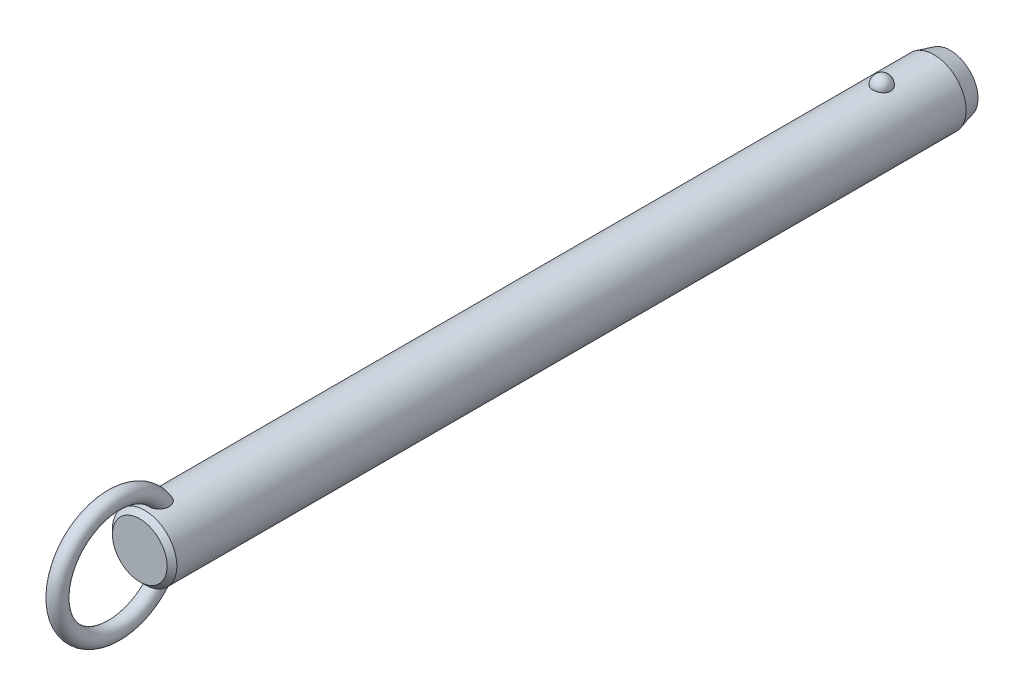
ISO-10303-21;
HEADER;
FILE_DESCRIPTION(('STEP AP214'),'2;1');
FILE_NAME('part.step','',(''),(''),'','','');
FILE_SCHEMA(('AUTOMOTIVE_DESIGN { 1 0 10303 214 1 1 1 1 }'));
ENDSEC;
DATA;
#1=APPLICATION_CONTEXT('core data for automotive mechanical design processes');
#2=APPLICATION_PROTOCOL_DEFINITION('international standard','automotive_design',2000,#1);
#3=PRODUCT_CONTEXT('',#1,'mechanical');
#4=PRODUCT('Part','Part','',(#3));
#5=PRODUCT_RELATED_PRODUCT_CATEGORY('part','',(#4));
#6=PRODUCT_DEFINITION_FORMATION('','',#4);
#7=PRODUCT_DEFINITION_CONTEXT('part definition',#1,'design');
#8=PRODUCT_DEFINITION('design','',#6,#7);
#9=PRODUCT_DEFINITION_SHAPE('','',#8);
#10=(LENGTH_UNIT() NAMED_UNIT(*) SI_UNIT(.MILLI.,.METRE.));
#11=(NAMED_UNIT(*) PLANE_ANGLE_UNIT() SI_UNIT($,.RADIAN.));
#12=(NAMED_UNIT(*) SI_UNIT($,.STERADIAN.) SOLID_ANGLE_UNIT());
#13=UNCERTAINTY_MEASURE_WITH_UNIT(LENGTH_MEASURE(1.E-05),#10,'distance_accuracy_value','');
#14=(GEOMETRIC_REPRESENTATION_CONTEXT(3) GLOBAL_UNCERTAINTY_ASSIGNED_CONTEXT((#13)) GLOBAL_UNIT_ASSIGNED_CONTEXT((#10,
#11,#12)) REPRESENTATION_CONTEXT('',''));
#15=CARTESIAN_POINT('',(0.,0.,0.));
#16=DIRECTION('',(0.,0.,1.));
#17=DIRECTION('',(1.,0.,0.));
#18=AXIS2_PLACEMENT_3D('',#15,#16,#17);
#19=CARTESIAN_POINT('',(0.,0.,170.2));
#20=DIRECTION('',(0.,0.,-1.));
#21=DIRECTION('',(-1.,0.,0.));
#22=AXIS2_PLACEMENT_3D('',#19,#20,#21);
#23=CYLINDRICAL_SURFACE('',#22,7.9);
#24=CARTESIAN_POINT('',(2.1785689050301,7.59367088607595,-2.20000000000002));
#25=CARTESIAN_POINT('',(2.17856679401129,7.59367269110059,-2.07701843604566));
#26=CARTESIAN_POINT('',(2.16853481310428,7.59657145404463,-1.95401006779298));
#27=CARTESIAN_POINT('',(2.12864689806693,7.607843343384,-1.71147811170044));
#28=CARTESIAN_POINT('',(2.09878338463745,7.61621856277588,-1.5919558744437));
#29=CARTESIAN_POINT('',(2.0199931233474,7.63749180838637,-1.35985638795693));
#30=CARTESIAN_POINT('',(1.97107475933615,7.6503878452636,-1.24727610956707));
#31=CARTESIAN_POINT('',(1.85539377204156,7.67926115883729,-1.03213234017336));
#32=CARTESIAN_POINT('',(1.78863158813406,7.69523835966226,-0.929568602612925));
#33=CARTESIAN_POINT('',(1.63856494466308,7.7285848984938,-0.73678633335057));
#34=CARTESIAN_POINT('',(1.55518140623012,7.7459606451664,-0.646630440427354));
#35=CARTESIAN_POINT('',(1.37422937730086,7.78009978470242,-0.481747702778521));
#36=CARTESIAN_POINT('',(1.27666086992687,7.79686317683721,-0.407020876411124));
#37=CARTESIAN_POINT('',(1.07024728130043,7.82786153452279,-0.275278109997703));
#38=CARTESIAN_POINT('',(0.961434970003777,7.84210353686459,-0.218212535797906));
#39=CARTESIAN_POINT('',(0.735351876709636,7.86652194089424,-0.123146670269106));
#40=CARTESIAN_POINT('',(0.618082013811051,7.87669878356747,-0.0851443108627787));
#41=CARTESIAN_POINT('',(0.380637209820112,7.89170521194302,-0.0298158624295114));
#42=CARTESIAN_POINT('',(0.260550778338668,7.89662650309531,-0.0121347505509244));
#43=CARTESIAN_POINT('',(0.0190117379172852,7.90090003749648,0.00324379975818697));
#44=CARTESIAN_POINT('',(-0.102440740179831,7.90025280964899,0.000943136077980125));
#45=CARTESIAN_POINT('',(-0.341452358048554,7.89351056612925,-0.0233955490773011));
#46=CARTESIAN_POINT('',(-0.459042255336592,7.88749257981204,-0.0451545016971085));
#47=CARTESIAN_POINT('',(-0.688796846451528,7.87075812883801,-0.107408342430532));
#48=CARTESIAN_POINT('',(-0.800961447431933,7.86004158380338,-0.14790355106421));
#49=CARTESIAN_POINT('',(-1.01743634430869,7.83497131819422,-0.246799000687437));
#50=CARTESIAN_POINT('',(-1.12169791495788,7.82059709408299,-0.305300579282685));
#51=CARTESIAN_POINT('',(-1.31891765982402,7.78976470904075,-0.43854939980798));
#52=CARTESIAN_POINT('',(-1.41187469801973,7.77330633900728,-0.513298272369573));
#53=CARTESIAN_POINT('',(-1.58577142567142,7.73972434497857,-0.678622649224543));
#54=CARTESIAN_POINT('',(-1.66645140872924,7.72259402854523,-0.769470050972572));
#55=CARTESIAN_POINT('',(-1.81161503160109,7.68983776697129,-0.963538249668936));
#56=CARTESIAN_POINT('',(-1.87609753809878,7.6742119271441,-1.0667599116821));
#57=CARTESIAN_POINT('',(-1.98790138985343,7.6460202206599,-1.28401170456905));
#58=CARTESIAN_POINT('',(-2.03501994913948,7.63349104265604,-1.39815107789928));
#59=CARTESIAN_POINT('',(-2.10986724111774,7.6131449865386,-1.6330178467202));
#60=CARTESIAN_POINT('',(-2.1375965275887,7.60532797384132,-1.75374505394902));
#61=CARTESIAN_POINT('',(-2.17289256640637,7.5953195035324,-1.99782562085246));
#62=CARTESIAN_POINT('',(-2.18054294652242,7.59310471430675,-2.12116592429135));
#63=CARTESIAN_POINT('',(-2.17572919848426,7.59448538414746,-2.36741799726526));
#64=CARTESIAN_POINT('',(-2.1632656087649,7.59808068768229,-2.49032977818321));
#65=CARTESIAN_POINT('',(-2.11865035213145,7.61064035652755,-2.73161015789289));
#66=CARTESIAN_POINT('',(-2.08659579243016,7.61957823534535,-2.84999812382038));
#67=CARTESIAN_POINT('',(-2.00367799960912,7.64179982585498,-3.07955956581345));
#68=CARTESIAN_POINT('',(-1.9528140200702,7.65508371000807,-3.19073275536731));
#69=CARTESIAN_POINT('',(-1.83321113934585,7.68460381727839,-3.40337899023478));
#70=CARTESIAN_POINT('',(-1.76437735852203,7.70085556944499,-3.5047965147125));
#71=CARTESIAN_POINT('',(-1.61069526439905,7.73445734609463,-3.69446912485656));
#72=CARTESIAN_POINT('',(-1.52584634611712,7.75180741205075,-3.78272371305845));
#73=CARTESIAN_POINT('',(-1.34198059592,7.78574608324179,-3.94393987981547));
#74=CARTESIAN_POINT('',(-1.24291308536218,7.80233167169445,-4.01684434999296));
#75=CARTESIAN_POINT('',(-1.03352039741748,7.83281625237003,-4.14489386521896));
#76=CARTESIAN_POINT('',(-0.92319600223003,7.84671543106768,-4.20004014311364));
#77=CARTESIAN_POINT('',(-0.695822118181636,7.87011575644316,-4.29042017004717));
#78=CARTESIAN_POINT('',(-0.578872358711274,7.87966903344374,-4.32589112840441));
#79=CARTESIAN_POINT('',(-0.340410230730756,7.8935652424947,-4.37692226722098));
#80=CARTESIAN_POINT('',(-0.218898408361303,7.89790879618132,-4.39248482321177));
#81=CARTESIAN_POINT('',(0.0228107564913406,7.90087453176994,-4.40314405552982));
#82=CARTESIAN_POINT('',(0.142990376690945,7.89960185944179,-4.39861683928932));
#83=CARTESIAN_POINT('',(0.380829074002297,7.89171262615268,-4.37008293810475));
#84=CARTESIAN_POINT('',(0.498488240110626,7.8850962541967,-4.34607694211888));
#85=CARTESIAN_POINT('',(0.727535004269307,7.86726442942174,-4.27939317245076));
#86=CARTESIAN_POINT('',(0.838944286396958,7.85606616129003,-4.23678512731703));
#87=CARTESIAN_POINT('',(1.05295421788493,7.83025654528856,-4.13408348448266));
#88=CARTESIAN_POINT('',(1.15555431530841,7.81564498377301,-4.07398879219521));
#89=CARTESIAN_POINT('',(1.35076763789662,7.7843022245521,-3.93687432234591));
#90=CARTESIAN_POINT('',(1.4432046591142,7.76754209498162,-3.85961036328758));
#91=CARTESIAN_POINT('',(1.6139111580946,7.73387857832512,-3.69076949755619));
#92=CARTESIAN_POINT('',(1.6921781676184,7.71697516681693,-3.59919010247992));
#93=CARTESIAN_POINT('',(1.83380875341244,7.6845643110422,-3.40247278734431));
#94=CARTESIAN_POINT('',(1.89689280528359,7.66908588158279,-3.29712873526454));
#95=CARTESIAN_POINT('',(2.0047823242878,7.64159441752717,-3.07707931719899));
#96=CARTESIAN_POINT('',(2.0495945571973,7.62958010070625,-2.96237743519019));
#97=CARTESIAN_POINT('',(2.11580183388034,7.61146617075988,-2.74040519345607));
#98=CARTESIAN_POINT('',(2.13929812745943,7.60484503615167,-2.63379846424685));
#99=CARTESIAN_POINT('',(2.17068242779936,7.59594664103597,-2.4181348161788));
#100=CARTESIAN_POINT('',(2.17857077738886,7.59366928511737,-2.30907795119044));
#101=CARTESIAN_POINT('',(2.1785689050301,7.59367088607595,-2.20000000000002));
#102=B_SPLINE_CURVE_WITH_KNOTS('',3,(#24,#25,#26,#27,#28,#29,#30,#31,#32,#33,#34,#35,#36,#37,
#38,#39,#40,#41,#42,#43,#44,#45,#46,#47,#48,#49,#50,#51,#52,#53,#54,#55,#56,#57,#58,#59,#60,#61,
#62,#63,#64,#65,#66,#67,#68,#69,#70,#71,#72,#73,#74,#75,#76,#77,#78,#79,#80,#81,#82,#83,#84,#85,
#86,#87,#88,#89,#90,#91,#92,#93,#94,#95,#96,#97,#98,#99,#100,#101),.UNSPECIFIED.,.T.,.F.,(4,2,2,
2,2,2,2,2,2,2,2,2,2,2,2,2,2,2,2,2,2,2,2,2,2,2,2,2,2,2,2,2,2,2,2,2,2,2,4),(0.,0.368552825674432,
0.737246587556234,1.10577831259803,1.4743009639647,1.8446206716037,2.21494081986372,
2.5842105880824,2.95344028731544,3.31611630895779,3.67875788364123,4.03628044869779,
4.39380913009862,4.75338791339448,5.11300280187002,5.47939989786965,5.8458226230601,
6.21639834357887,6.58696347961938,6.95598276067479,7.32499216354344,7.69218715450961,
8.0593967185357,8.42858578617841,8.79778880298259,9.16834203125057,9.5388695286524,
9.90482699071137,10.2707407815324,10.6298333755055,10.9889132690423,11.3466585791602,
11.7044262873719,12.0676511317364,12.4309391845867,12.8004764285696,13.1698767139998,
13.4967701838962,13.8236564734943),.UNSPECIFIED.);
#103=CARTESIAN_POINT('',(2.1785689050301,7.59367088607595,-2.20000000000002));
#104=VERTEX_POINT('',#103);
#105=EDGE_CURVE('E41',#104,#104,#102,.T.);
#106=ORIENTED_EDGE('',*,*,#105,.T.);
#107=EDGE_LOOP('',(#106));
#108=FACE_BOUND('',#107,.T.);
#109=CARTESIAN_POINT('',(0.,0.,178.52));
#110=DIRECTION('',(0.,0.,1.));
#111=DIRECTION('',(1.,0.,0.));
#112=AXIS2_PLACEMENT_3D('',#109,#110,#111);
#113=CIRCLE('',#112,7.9);
#114=CARTESIAN_POINT('',(7.9,0.,178.52));
#115=VERTEX_POINT('',#114);
#116=EDGE_CURVE('E10',#115,#115,#113,.F.);
#117=ORIENTED_EDGE('',*,*,#116,.T.);
#118=EDGE_LOOP('',(#117));
#119=FACE_BOUND('',#118,.T.);
#120=CARTESIAN_POINT('',(-0.630969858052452,-7.87476203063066,172.412432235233));
#121=CARTESIAN_POINT('',(-0.734180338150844,-7.86648998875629,172.447285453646));
#122=CARTESIAN_POINT('',(-0.834476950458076,-7.85639291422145,172.490816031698));
#123=CARTESIAN_POINT('',(-1.02620356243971,-7.83366343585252,172.594094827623));
#124=CARTESIAN_POINT('',(-1.1176141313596,-7.82102565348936,172.653877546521));
#125=CARTESIAN_POINT('',(-1.28877277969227,-7.79464922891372,172.787839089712));
#126=CARTESIAN_POINT('',(-1.36854014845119,-7.7809124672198,172.861993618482));
#127=CARTESIAN_POINT('',(-1.51461521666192,-7.75380398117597,173.022494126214));
#128=CARTESIAN_POINT('',(-1.58092966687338,-7.74043207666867,173.108833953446));
#129=CARTESIAN_POINT('',(-1.70019064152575,-7.7151252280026,173.292978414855));
#130=CARTESIAN_POINT('',(-1.75284037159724,-7.70322473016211,173.390979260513));
#131=CARTESIAN_POINT('',(-1.84263464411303,-7.68224112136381,173.594102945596));
#132=CARTESIAN_POINT('',(-1.87977299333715,-7.6731591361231,173.699228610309));
#133=CARTESIAN_POINT('',(-1.94152728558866,-7.65777930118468,173.923284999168));
#134=CARTESIAN_POINT('',(-1.96475471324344,-7.65179654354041,174.042616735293));
#135=CARTESIAN_POINT('',(-1.99449499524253,-7.64409642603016,174.28342986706));
#136=CARTESIAN_POINT('',(-2.0010005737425,-7.64238092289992,174.404912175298));
#137=CARTESIAN_POINT('',(-1.99856014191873,-7.64302120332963,174.668340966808));
#138=CARTESIAN_POINT('',(-1.98680021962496,-7.64611845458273,174.81025654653));
#139=CARTESIAN_POINT('',(-1.94457772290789,-7.65696186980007,175.091118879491));
#140=CARTESIAN_POINT('',(-1.91409393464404,-7.66471330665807,175.230062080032));
#141=CARTESIAN_POINT('',(-1.82768670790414,-7.68582947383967,175.531939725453));
#142=CARTESIAN_POINT('',(-1.76772963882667,-7.70003779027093,175.693686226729));
#143=CARTESIAN_POINT('',(-1.65998501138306,-7.72371550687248,175.927695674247));
#144=CARTESIAN_POINT('',(-1.62107967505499,-7.73200670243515,176.004297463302));
#145=CARTESIAN_POINT('',(-1.53727726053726,-7.74910377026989,176.154079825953));
#146=CARTESIAN_POINT('',(-1.4923821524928,-7.75790947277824,176.227261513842));
#147=CARTESIAN_POINT('',(-1.37397050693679,-7.77993338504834,176.40288382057));
#148=CARTESIAN_POINT('',(-1.29690364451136,-7.79328473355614,176.502955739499));
#149=CARTESIAN_POINT('',(-1.1288548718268,-7.81939266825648,176.690714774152));
#150=CARTESIAN_POINT('',(-1.03789926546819,-7.83215032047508,176.778424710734));
#151=CARTESIAN_POINT('',(-0.869532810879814,-7.85231710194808,176.913414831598));
#152=CARTESIAN_POINT('',(-0.795716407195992,-7.86021093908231,176.965076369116));
#153=CARTESIAN_POINT('',(-0.640813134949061,-7.87434920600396,177.056381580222));
#154=CARTESIAN_POINT('',(-0.559737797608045,-7.88059619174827,177.09604389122));
#155=CARTESIAN_POINT('',(-0.406456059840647,-7.88984116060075,177.154300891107));
#156=CARTESIAN_POINT('',(-0.335227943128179,-7.89321892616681,177.175384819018));
#157=CARTESIAN_POINT('',(-0.190193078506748,-7.89804235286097,177.20541418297));
#158=CARTESIAN_POINT('',(-0.11638863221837,-7.89948969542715,177.214370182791));
#159=CARTESIAN_POINT('',(0.0318414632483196,-7.90028409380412,177.219291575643));
#160=CARTESIAN_POINT('',(0.106268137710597,-7.89962640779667,177.215227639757));
#161=CARTESIAN_POINT('',(0.253290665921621,-7.8962818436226,177.194461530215));
#162=CARTESIAN_POINT('',(0.325885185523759,-7.8935935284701,177.177750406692));
#163=CARTESIAN_POINT('',(0.481441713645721,-7.88577340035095,177.128738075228));
#164=CARTESIAN_POINT('',(0.563611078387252,-7.88026321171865,177.094005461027));
#165=CARTESIAN_POINT('',(0.721129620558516,-7.86741729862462,177.011796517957));
#166=CARTESIAN_POINT('',(0.79646633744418,-7.86007832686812,176.964297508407));
#167=CARTESIAN_POINT('',(0.971456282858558,-7.84073285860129,176.836513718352));
#168=CARTESIAN_POINT('',(1.06719686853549,-7.82809461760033,176.751004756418));
#169=CARTESIAN_POINT('',(1.24418921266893,-7.80192439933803,176.566232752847));
#170=CARTESIAN_POINT('',(1.32540832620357,-7.78839049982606,176.466939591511));
#171=CARTESIAN_POINT('',(1.45199971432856,-7.76559693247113,176.289576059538));
#172=CARTESIAN_POINT('',(1.50085649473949,-7.75626094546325,176.213954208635));
#173=CARTESIAN_POINT('',(1.59197749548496,-7.7380727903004,176.058742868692));
#174=CARTESIAN_POINT('',(1.63423919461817,-7.72922080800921,175.979151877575));
#175=CARTESIAN_POINT('',(1.71222612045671,-7.71231959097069,175.816664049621));
#176=CARTESIAN_POINT('',(1.74794516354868,-7.70427111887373,175.733764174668));
#177=CARTESIAN_POINT('',(1.81270113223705,-7.68929240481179,175.565296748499));
#178=CARTESIAN_POINT('',(1.84173789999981,-7.68236218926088,175.479729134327));
#179=CARTESIAN_POINT('',(1.89322698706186,-7.6698375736,175.30528702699));
#180=CARTESIAN_POINT('',(1.91558744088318,-7.66426199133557,175.216383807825));
#181=CARTESIAN_POINT('',(1.95281367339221,-7.65485915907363,175.036969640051));
#182=CARTESIAN_POINT('',(1.96767946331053,-7.65103190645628,174.946458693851));
#183=CARTESIAN_POINT('',(2.00021456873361,-7.64262981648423,174.673732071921));
#184=CARTESIAN_POINT('',(2.00600691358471,-7.6410871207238,174.489709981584));
#185=CARTESIAN_POINT('',(1.98445334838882,-7.64669564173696,174.176501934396));
#186=CARTESIAN_POINT('',(1.96607186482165,-7.65149688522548,174.046618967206));
#187=CARTESIAN_POINT('',(1.90884967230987,-7.6659762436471,173.791632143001));
#188=CARTESIAN_POINT('',(1.87002101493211,-7.67565148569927,173.666525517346));
#189=CARTESIAN_POINT('',(1.77063986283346,-7.69918471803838,173.42454013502));
#190=CARTESIAN_POINT('',(1.70993724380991,-7.71307150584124,173.307725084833));
#191=CARTESIAN_POINT('',(1.56733070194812,-7.74330306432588,173.088144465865));
#192=CARTESIAN_POINT('',(1.48543692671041,-7.75964665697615,172.985372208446));
#193=CARTESIAN_POINT('',(1.31346177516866,-7.79047523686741,172.809380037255));
#194=CARTESIAN_POINT('',(1.22547278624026,-7.80495298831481,172.734106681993));
#195=CARTESIAN_POINT('',(1.0372435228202,-7.83218597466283,172.600486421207));
#196=CARTESIAN_POINT('',(0.937008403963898,-7.84494192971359,172.542132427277));
#197=CARTESIAN_POINT('',(0.733599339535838,-7.86649045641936,172.447027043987));
#198=CARTESIAN_POINT('',(0.63094101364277,-7.87547134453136,172.409210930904));
#199=CARTESIAN_POINT('',(0.420465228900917,-7.88950708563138,172.351116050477));
#200=CARTESIAN_POINT('',(0.31264590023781,-7.89456050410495,172.33084369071));
#201=CARTESIAN_POINT('',(0.0960869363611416,-7.9001518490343,172.308455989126));
#202=CARTESIAN_POINT('',(-0.012634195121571,-7.90073226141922,172.306169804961));
#203=CARTESIAN_POINT('',(-0.228766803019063,-7.89742350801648,172.319367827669));
#204=CARTESIAN_POINT('',(-0.336180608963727,-7.89354403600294,172.334813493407));
#205=CARTESIAN_POINT('',(-0.473410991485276,-7.88586871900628,172.366217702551));
#206=CARTESIAN_POINT('',(-0.505257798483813,-7.88388984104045,172.374354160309));
#207=CARTESIAN_POINT('',(-0.568481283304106,-7.87958326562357,172.392208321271));
#208=CARTESIAN_POINT('',(-0.599857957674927,-7.87725556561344,172.401926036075));
#209=CARTESIAN_POINT('',(-0.630969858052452,-7.87476203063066,172.412432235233));
#210=B_SPLINE_CURVE_WITH_KNOTS('',3,(#120,#121,#122,#123,#124,#125,#126,#127,#128,#129,#130,
#131,#132,#133,#134,#135,#136,#137,#138,#139,#140,#141,#142,#143,#144,#145,#146,#147,#148,#149,
#150,#151,#152,#153,#154,#155,#156,#157,#158,#159,#160,#161,#162,#163,#164,#165,#166,#167,#168,
#169,#170,#171,#172,#173,#174,#175,#176,#177,#178,#179,#180,#181,#182,#183,#184,#185,#186,#187,
#188,#189,#190,#191,#192,#193,#194,#195,#196,#197,#198,#199,#200,#201,#202,#203,#204,#205,#206,
#207,#208,#209),.UNSPECIFIED.,.T.,.F.,(4,2,2,2,2,2,2,2,2,2,2,2,2,2,2,2,2,2,2,2,2,2,2,2,2,2,2,2,
2,2,2,2,2,2,2,2,2,2,2,2,2,2,2,2,4),(0.,0.327622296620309,0.655945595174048,0.98371863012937,
1.3113267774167,1.64554655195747,1.97989964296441,2.34365728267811,2.70757317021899,
3.13333684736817,3.55958380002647,4.07655306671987,4.33527897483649,4.59391999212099,
4.97382437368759,5.353017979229,5.62348245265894,5.89352465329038,6.11565959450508,
6.33760092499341,6.56004255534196,6.78264174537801,7.04930844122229,7.31645206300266,
7.70130871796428,8.08701995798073,8.35824509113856,8.62957365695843,8.90115735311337,
9.1727474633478,9.44791855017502,9.72308922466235,10.2715298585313,10.6638393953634,
11.0559179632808,11.4507403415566,11.8453740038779,12.1936425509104,12.5417649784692,
12.8695063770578,13.1973674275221,13.5221104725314,13.8461490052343,13.9449071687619,
14.0436660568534),.UNSPECIFIED.);
#211=CARTESIAN_POINT('',(-0.630969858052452,-7.87476203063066,172.412432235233));
#212=VERTEX_POINT('',#211);
#213=EDGE_CURVE('E59',#212,#212,#210,.T.);
#214=ORIENTED_EDGE('',*,*,#213,.T.);
#215=EDGE_LOOP('',(#214));
#216=FACE_BOUND('',#215,.T.);
#217=CARTESIAN_POINT('',(-0.630969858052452,7.87476203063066,172.412432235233));
#218=CARTESIAN_POINT('',(-0.528918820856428,7.88293636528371,172.377979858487));
#219=CARTESIAN_POINT('',(-0.423745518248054,7.88934810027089,172.351915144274));
#220=CARTESIAN_POINT('',(-0.210236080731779,7.8979273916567,172.317282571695));
#221=CARTESIAN_POINT('',(-0.101893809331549,7.90008607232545,172.308751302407));
#222=CARTESIAN_POINT('',(0.11466056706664,7.89990877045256,172.309457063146));
#223=CARTESIAN_POINT('',(0.222872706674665,7.89757640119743,172.31867980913));
#224=CARTESIAN_POINT('',(0.436107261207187,7.88867538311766,172.354652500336));
#225=CARTESIAN_POINT('',(0.541131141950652,7.8821087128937,172.38139425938));
#226=CARTESIAN_POINT('',(0.745085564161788,7.86545130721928,172.451756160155));
#227=CARTESIAN_POINT('',(0.844015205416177,7.85536005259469,172.495378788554));
#228=CARTESIAN_POINT('',(1.03299167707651,7.83275153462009,172.598379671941));
#229=CARTESIAN_POINT('',(1.12303841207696,7.8202342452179,172.657758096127));
#230=CARTESIAN_POINT('',(1.29214734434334,7.79408219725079,172.790864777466));
#231=CARTESIAN_POINT('',(1.37116907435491,7.78044359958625,172.864643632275));
#232=CARTESIAN_POINT('',(1.51597677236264,7.75353170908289,173.024235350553));
#233=CARTESIAN_POINT('',(1.58176261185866,7.74025841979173,173.110048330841));
#234=CARTESIAN_POINT('',(1.70057386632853,7.71504069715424,173.293644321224));
#235=CARTESIAN_POINT('',(1.75320073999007,7.7031425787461,173.391690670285));
#236=CARTESIAN_POINT('',(1.8429376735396,7.68216822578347,173.594893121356));
#237=CARTESIAN_POINT('',(1.88004278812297,7.67309289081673,173.700051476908));
#238=CARTESIAN_POINT('',(1.9417232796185,7.6577294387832,173.924167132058));
#239=CARTESIAN_POINT('',(1.96491037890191,7.65175648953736,174.043524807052));
#240=CARTESIAN_POINT('',(1.9945689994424,7.64407702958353,174.284384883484));
#241=CARTESIAN_POINT('',(2.00103304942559,7.64237242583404,174.40588821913));
#242=CARTESIAN_POINT('',(1.99850166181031,7.64303650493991,174.669368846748));
#243=CARTESIAN_POINT('',(1.98669038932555,7.64614714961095,174.811314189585));
#244=CARTESIAN_POINT('',(1.94436120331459,7.6570170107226,175.092228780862));
#245=CARTESIAN_POINT('',(1.91382203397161,7.66478150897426,175.231194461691));
#246=CARTESIAN_POINT('',(1.82728754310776,7.68592483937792,175.533111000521));
#247=CARTESIAN_POINT('',(1.76725778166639,7.7001468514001,175.694872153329));
#248=CARTESIAN_POINT('',(1.65939700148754,7.72384204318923,175.928891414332));
#249=CARTESIAN_POINT('',(1.62045187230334,7.73213852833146,176.005494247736));
#250=CARTESIAN_POINT('',(1.53656684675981,7.74924489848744,176.155273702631));
#251=CARTESIAN_POINT('',(1.49162892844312,7.75805461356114,176.228451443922));
#252=CARTESIAN_POINT('',(1.37317698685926,7.78007342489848,176.403952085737));
#253=CARTESIAN_POINT('',(1.29612360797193,7.79341423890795,176.503911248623));
#254=CARTESIAN_POINT('',(1.12812043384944,7.81949839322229,176.69145083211));
#255=CARTESIAN_POINT('',(1.03719688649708,7.83224280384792,176.779054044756));
#256=CARTESIAN_POINT('',(0.868871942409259,7.85239026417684,176.91389715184));
#257=CARTESIAN_POINT('',(0.795056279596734,7.86027769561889,176.965511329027));
#258=CARTESIAN_POINT('',(0.640160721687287,7.87440222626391,177.056720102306));
#259=CARTESIAN_POINT('',(0.559092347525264,7.88064188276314,177.096333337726));
#260=CARTESIAN_POINT('',(0.405820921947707,7.8898738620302,177.154505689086));
#261=CARTESIAN_POINT('',(0.334594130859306,7.89324577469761,177.175552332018));
#262=CARTESIAN_POINT('',(0.189568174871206,7.89805733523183,177.205507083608));
#263=CARTESIAN_POINT('',(0.115771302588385,7.89949866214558,177.214425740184));
#264=CARTESIAN_POINT('',(-0.0324359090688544,7.90028156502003,177.21927589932));
#265=CARTESIAN_POINT('',(-0.106847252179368,7.89961843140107,177.215178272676));
#266=CARTESIAN_POINT('',(-0.253834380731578,7.8962642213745,177.194351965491));
#267=CARTESIAN_POINT('',(-0.326408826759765,7.89357170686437,177.177614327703));
#268=CARTESIAN_POINT('',(-0.481962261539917,7.88574179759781,177.128539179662));
#269=CARTESIAN_POINT('',(-0.564145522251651,7.88022507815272,177.093763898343));
#270=CARTESIAN_POINT('',(-0.7216852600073,7.86736646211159,177.011468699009));
#271=CARTESIAN_POINT('',(-0.797029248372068,7.8600213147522,176.963926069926));
#272=CARTESIAN_POINT('',(-0.972044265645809,7.84066026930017,176.836026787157));
#273=CARTESIAN_POINT('',(-1.0677980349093,7.828012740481,176.750443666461));
#274=CARTESIAN_POINT('',(-1.24480531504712,7.80182621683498,176.565522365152));
#275=CARTESIAN_POINT('',(-1.32602618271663,7.78828530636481,176.466154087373));
#276=CARTESIAN_POINT('',(-1.4525983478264,7.76548487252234,176.288680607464));
#277=CARTESIAN_POINT('',(-1.50143856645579,7.75614818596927,176.213025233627));
#278=CARTESIAN_POINT('',(-1.59252410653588,7.73796020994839,176.057748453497));
#279=CARTESIAN_POINT('',(-1.63476690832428,7.729109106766,175.978125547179));
#280=CARTESIAN_POINT('',(-1.71271318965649,7.71221133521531,175.815575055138));
#281=CARTESIAN_POINT('',(-1.74841047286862,7.70416543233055,175.732644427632));
#282=CARTESIAN_POINT('',(-1.81311929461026,7.6891937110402,175.564116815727));
#283=CARTESIAN_POINT('',(-1.84213067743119,7.68226791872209,175.478519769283));
#284=CARTESIAN_POINT('',(-1.89356259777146,7.66975461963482,175.304025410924));
#285=CARTESIAN_POINT('',(-1.91589165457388,7.66418586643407,175.215099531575));
#286=CARTESIAN_POINT('',(-1.9530507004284,7.65479859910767,175.035642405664));
#287=CARTESIAN_POINT('',(-1.96788069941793,7.65098008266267,174.945111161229));
#288=CARTESIAN_POINT('',(-2.00030078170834,7.64260704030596,174.672327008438));
#289=CARTESIAN_POINT('',(-2.00600576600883,7.64108760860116,174.488271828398));
#290=CARTESIAN_POINT('',(-1.9842848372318,7.64673945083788,174.175080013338));
#291=CARTESIAN_POINT('',(-1.96583698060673,7.65155751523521,174.045240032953));
#292=CARTESIAN_POINT('',(-1.90848948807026,7.66606613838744,173.790361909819));
#293=CARTESIAN_POINT('',(-1.86960376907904,7.67575338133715,173.665320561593));
#294=CARTESIAN_POINT('',(-1.77013421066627,7.6993013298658,173.423500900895));
#295=CARTESIAN_POINT('',(-1.70940488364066,7.71318991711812,173.306784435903));
#296=CARTESIAN_POINT('',(-1.5667295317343,7.74342495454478,173.087340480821));
#297=CARTESIAN_POINT('',(-1.48478316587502,7.75977144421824,172.98461321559));
#298=CARTESIAN_POINT('',(-1.31266325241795,7.79061163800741,172.808643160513));
#299=CARTESIAN_POINT('',(-1.22456383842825,7.80509908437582,172.733358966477));
#300=CARTESIAN_POINT('',(-1.03622400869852,7.83231881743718,172.599865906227));
#301=CARTESIAN_POINT('',(-0.936015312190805,7.84505551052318,172.541613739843));
#302=CARTESIAN_POINT('',(-0.798824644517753,7.85957802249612,172.477540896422));
#303=CARTESIAN_POINT('',(-0.765787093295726,7.86286821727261,172.463224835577));
#304=CARTESIAN_POINT('',(-0.698939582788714,7.86909211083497,172.436436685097));
#305=CARTESIAN_POINT('',(-0.665129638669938,7.8720258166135,172.423964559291));
#306=CARTESIAN_POINT('',(-0.630969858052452,7.87476203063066,172.412432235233));
#307=B_SPLINE_CURVE_WITH_KNOTS('',3,(#217,#218,#219,#220,#221,#222,#223,#224,#225,#226,#227,
#228,#229,#230,#231,#232,#233,#234,#235,#236,#237,#238,#239,#240,#241,#242,#243,#244,#245,#246,
#247,#248,#249,#250,#251,#252,#253,#254,#255,#256,#257,#258,#259,#260,#261,#262,#263,#264,#265,
#266,#267,#268,#269,#270,#271,#272,#273,#274,#275,#276,#277,#278,#279,#280,#281,#282,#283,#284,
#285,#286,#287,#288,#289,#290,#291,#292,#293,#294,#295,#296,#297,#298,#299,#300,#301,#302,#303,
#304,#305,#306),.UNSPECIFIED.,.T.,.F.,(4,2,2,2,2,2,2,2,2,2,2,2,2,2,2,2,2,2,2,2,2,2,2,2,2,2,2,2,
2,2,2,2,2,2,2,2,2,2,2,2,2,2,2,2,4),(0.,0.323920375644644,0.648516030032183,0.972850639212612,
1.29703380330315,1.62126473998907,1.94549915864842,2.27089401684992,2.59629203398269,
2.93059633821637,3.26500707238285,3.6288164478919,3.99278833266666,4.4186542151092,
4.84500434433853,5.36209210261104,5.62087589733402,5.87957448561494,6.25918598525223,
6.63808782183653,6.90846748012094,7.17842501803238,7.40052350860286,7.62242871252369,
7.84483086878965,8.0673907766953,8.33414615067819,8.60137921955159,8.98641454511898,
9.37230415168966,9.64358673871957,9.91497268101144,10.1866142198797,10.4582620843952,
10.7334745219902,11.008686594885,11.5572126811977,11.9494246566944,12.3413699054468,
12.7359755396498,13.1305875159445,13.4791770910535,13.82687259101,13.9353013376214,
14.0437279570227),.UNSPECIFIED.);
#308=CARTESIAN_POINT('',(-0.630969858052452,7.87476203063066,172.412432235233));
#309=VERTEX_POINT('',#308);
#310=EDGE_CURVE('E66',#309,#309,#307,.T.);
#311=ORIENTED_EDGE('',*,*,#310,.T.);
#312=EDGE_LOOP('',(#311));
#313=FACE_BOUND('',#312,.T.);
#314=CARTESIAN_POINT('',(0.,0.,-15.));
#315=DIRECTION('',(0.,0.,-1.));
#316=DIRECTION('',(-1.,0.,0.));
#317=AXIS2_PLACEMENT_3D('',#314,#315,#316);
#318=CIRCLE('',#317,7.9);
#319=CARTESIAN_POINT('',(-7.9,0.,-15.));
#320=VERTEX_POINT('',#319);
#321=EDGE_CURVE('E56',#320,#320,#318,.F.);
#322=ORIENTED_EDGE('',*,*,#321,.T.);
#323=EDGE_LOOP('',(#322));
#324=FACE_BOUND('',#323,.T.);
#325=ADVANCED_FACE('F37',(#108,#119,#216,#313,#324),#23,.T.);
#326=CARTESIAN_POINT('',(0.,0.,-19.));
#327=DIRECTION('',(0.,0.,-1.));
#328=DIRECTION('',(-1.,0.,0.));
#329=AXIS2_PLACEMENT_3D('',#326,#327,#328);
#330=PLANE('',#329);
#331=CARTESIAN_POINT('',(0.,0.,-19.));
#332=DIRECTION('',(0.,0.,-1.));
#333=DIRECTION('',(-1.,0.,0.));
#334=AXIS2_PLACEMENT_3D('',#331,#332,#333);
#335=CIRCLE('',#334,6.82820323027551);
#336=CARTESIAN_POINT('',(-6.82820323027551,0.,-19.));
#337=VERTEX_POINT('',#336);
#338=EDGE_CURVE('E65',#337,#337,#335,.T.);
#339=ORIENTED_EDGE('',*,*,#338,.T.);
#340=EDGE_LOOP('',(#339));
#341=FACE_BOUND('',#340,.T.);
#342=ADVANCED_FACE('F84',(#341),#330,.T.);
#343=CARTESIAN_POINT('',(0.,0.,-19.));
#344=DIRECTION('',(0.,0.,1.));
#345=DIRECTION('',(1.,0.,0.));
#346=AXIS2_PLACEMENT_3D('',#343,#344,#345);
#347=CONICAL_SURFACE('',#346,6.82820323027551,0.261799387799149);
#348=ORIENTED_EDGE('',*,*,#321,.F.);
#349=EDGE_LOOP('',(#348));
#350=FACE_BOUND('',#349,.T.);
#351=ORIENTED_EDGE('',*,*,#338,.F.);
#352=EDGE_LOOP('',(#351));
#353=FACE_BOUND('',#352,.T.);
#354=ADVANCED_FACE('F82',(#350,#353),#347,.T.);
#355=CARTESIAN_POINT('',(0.,0.,179.72));
#356=DIRECTION('',(0.,0.,1.));
#357=DIRECTION('',(1.,0.,0.));
#358=AXIS2_PLACEMENT_3D('',#355,#356,#357);
#359=PLANE('',#358);
#360=CARTESIAN_POINT('',(0.,0.,179.72));
#361=DIRECTION('',(0.,0.,1.));
#362=DIRECTION('',(1.,0.,0.));
#363=AXIS2_PLACEMENT_3D('',#360,#361,#362);
#364=CIRCLE('',#363,6.69999999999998);
#365=CARTESIAN_POINT('',(6.69999999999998,0.,179.72));
#366=VERTEX_POINT('',#365);
#367=EDGE_CURVE('E50',#366,#366,#364,.T.);
#368=ORIENTED_EDGE('',*,*,#367,.T.);
#369=EDGE_LOOP('',(#368));
#370=FACE_BOUND('',#369,.T.);
#371=ADVANCED_FACE('F76',(#370),#359,.T.);
#372=CARTESIAN_POINT('',(0.,0.,186.05));
#373=DIRECTION('',(1.,0.,0.));
#374=DIRECTION('',(0.,0.,-1.));
#375=AXIS2_PLACEMENT_3D('',#372,#373,#374);
#376=TOROIDAL_SURFACE('',#375,13.85,2.);
#377=ORIENTED_EDGE('',*,*,#310,.F.);
#378=EDGE_LOOP('',(#377));
#379=FACE_BOUND('',#378,.T.);
#380=ORIENTED_EDGE('',*,*,#213,.F.);
#381=EDGE_LOOP('',(#380));
#382=FACE_BOUND('',#381,.T.);
#383=ADVANCED_FACE('F72',(#379,#382),#376,.T.);
#384=CARTESIAN_POINT('',(0.,0.,179.72));
#385=DIRECTION('',(0.,0.,-1.));
#386=DIRECTION('',(-1.,0.,0.));
#387=AXIS2_PLACEMENT_3D('',#384,#385,#386);
#388=CONICAL_SURFACE('',#387,6.69999999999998,0.785398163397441);
#389=ORIENTED_EDGE('',*,*,#116,.F.);
#390=EDGE_LOOP('',(#389));
#391=FACE_BOUND('',#390,.T.);
#392=ORIENTED_EDGE('',*,*,#367,.F.);
#393=EDGE_LOOP('',(#392));
#394=FACE_BOUND('',#393,.T.);
#395=ADVANCED_FACE('F39',(#391,#394),#388,.T.);
#396=CARTESIAN_POINT('',(0.,7.9,-2.20000000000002));
#397=DIRECTION('',(0.,1.,0.));
#398=DIRECTION('',(0.,0.,1.));
#399=AXIS2_PLACEMENT_3D('',#396,#397,#398);
#400=SPHERICAL_SURFACE('',#399,2.2);
#401=ORIENTED_EDGE('',*,*,#105,.F.);
#402=EDGE_LOOP('',(#401));
#403=FACE_BOUND('',#402,.T.);
#404=ADVANCED_FACE('F78',(#403),#400,.T.);
#405=CLOSED_SHELL('',(#325,#342,#354,#371,#383,#395,#404));
#406=MANIFOLD_SOLID_BREP('B2',#405);
#407=ADVANCED_BREP_SHAPE_REPRESENTATION('',(#18,#406),#14);
#408=SHAPE_DEFINITION_REPRESENTATION(#9,#407);
ENDSEC;
END-ISO-10303-21;
